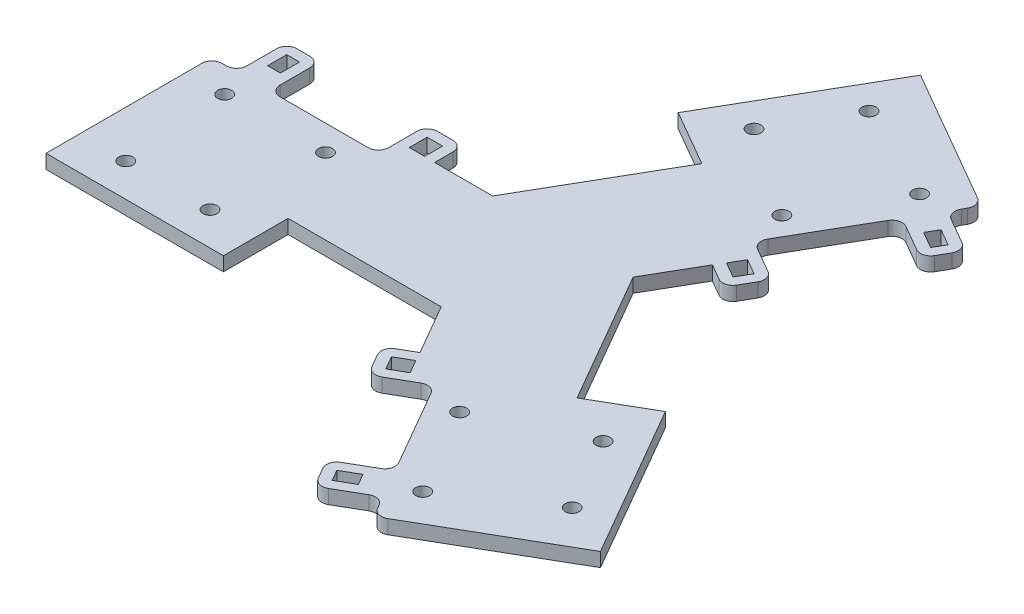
from build123d import *

# Parameters (mm, degrees)
SKETCH3_W           = 69.5
SKETCH3_H           = 65
SKETCH3_W_2         = 63.5
SKETCH3_H_2         = 59
BOSS_EXTRUDE1_DEPTH = 3
SKETCH4_W           = 69.5
SKETCH4_H           = 65
BOSS_EXTRUDE2_DEPTH = 5.5
CIRPATTERN3_COUNT   = 3
CUT_EXTRUDE2_DEPTH  = 10
BOSS_EXTRUDE3_DEPTH = 3
CUT_EXTRUDE3_DEPTH  = 10
BOSS_EXTRUDE4_DEPTH = 3
SKETCH13_W          = 82.978771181
SKETCH13_H          = 57.040542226
CUT_EXTRUDE4_DEPTH  = 3
SKETCH15_W          = 69.5
SKETCH15_H          = 3
BOSS_EXTRUDE5_DEPTH = 3
SKETCH16_W          = 13
SKETCH16_H          = 19.62
SKETCH16_W_2        = 5
SKETCH16_H_2        = 7.5
SKETCH16_W_3        = 6.047492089
SKETCH16_H_3        = 7
BOSS_EXTRUDE6_DEPTH = 5.5
CIRPATTERN6_COUNT   = 3
FILLET1_R           = 4
FILLET2_R           = 4
FILLET3_R           = 4
FILLET4_R           = 4
FILLET5_R           = 4
FILLET6_R           = 4
FILLET7_R           = 4
FILLET8_R           = 4
FILLET9_R           = 4
SKETCH17_R          = 2.75
CUT_EXTRUDE5_DEPTH  = 10
SKETCH18_R          = 2.75
CUT_EXTRUDE6_DEPTH  = 10
SKETCH20_W          = 65.1
SKETCH20_H          = 42.78
CUT_EXTRUDE7_DEPTH  = 3
CIRPATTERN7_COUNT   = 3
SKETCH27_W          = 419.814756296
SKETCH27_H          = 327.807450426
CUT_EXTRUDE9_DEPTH  = 390
BOSS_EXTRUDE7_DEPTH = 5.5


with BuildPart() as part:
    # Sketch3 → Boss-Extrude1 (new body)
    with BuildSketch(Plane(origin=(0, 0, 0), x_dir=(1, 0, 0), z_dir=(0, 1, 0))):
        with Locations((26.22826087, -18.027173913)):
            Rectangle(SKETCH3_W, SKETCH3_H)
        with Locations((26.22826087, -18.027173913)):
            Rectangle(SKETCH3_W_2, SKETCH3_H_2, mode=Mode.SUBTRACT)
    extrude(amount=BOSS_EXTRUDE1_DEPTH)

    # Sketch4 → Boss-Extrude2 (add)
    with BuildSketch(Plane(origin=(0, 3, 0), x_dir=(1, 0, 0), z_dir=(0, 1, 0))):
        with Locations((26.22826087, -18.027173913)):
            Rectangle(SKETCH4_W, SKETCH4_H)
    extrude(amount=BOSS_EXTRUDE2_DEPTH)


with BuildPart() as cirpattern3_1:
    # CirPattern3: pattern copy
    add(part.part.rotate(Axis((120.97826087, 0, -6.582826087), (0, 1, 0)), 1 * 360 / CIRPATTERN3_COUNT))

    # Sketch9 → Cut-Extrude2 (cut)
    with BuildSketch(Plane.XZ.offset(-3)):
        Polygon((197.088747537, 99.38440381), (174.375371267, 112.497977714), (139.363302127, 51.855295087), (162.076678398, 38.741721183), align=None)
    extrude(amount=CUT_EXTRUDE2_DEPTH, mode=Mode.SUBTRACT)

    # Sketch10 → Boss-Extrude3 (add)
    with BuildSketch(Plane.XZ.offset(-3)):
        Polygon((196.92596934, 99.102463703), (162.17596934, 38.91369814), (159.577893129, 40.41369814), (194.327893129, 100.602463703), align=None)
    extrude(amount=BOSS_EXTRUDE3_DEPTH)

    # Fillet9
    fillet9_edges = [cirpattern3_1.edges().sort_by_distance(p)[0] for p in [
        (178.895320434, 5.75, 109.512463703),
    ]]
    fillet(fillet9_edges, radius=FILLET9_R)


with BuildPart() as cirpattern3_2:
    # CirPattern3: pattern copy
    add(part.part.rotate(Axis((120.97826087, 0, -6.582826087), (0, 1, 0)), 2 * 360 / CIRPATTERN3_COUNT))

    # Sketch11 → Cut-Extrude3 (cut)
    with BuildSketch(Plane.XZ.offset(-3)):
        Polygon((174.619846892, -125.352778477), (139.700043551, -64.869904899), (160.048933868, -53.121467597), (194.96873721, -113.604341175), align=None)
    extrude(amount=CUT_EXTRUDE3_DEPTH, mode=Mode.SUBTRACT)

    # Sketch12 → Boss-Extrude4 (add)
    with BuildSketch(Plane(origin=(0, 3, 0), x_dir=(-1, 0, 0), z_dir=(0, -1, 0))):
        Polygon((-174.530552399, 125.198115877), (-139.780552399, 65.009350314), (-142.37862861, 63.509350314), (-177.12862861, 123.698115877), align=None)
    extrude(amount=BOSS_EXTRUDE4_DEPTH)

    # Fillet7
    fillet7_edges = [cirpattern3_2.edges().sort_by_distance(p)[0] for p in [
        (192.561201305, 5.75, -114.788115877),
    ]]
    fillet(fillet7_edges, radius=FILLET7_R)


with BuildPart() as part_1:
    add(part.part)

    # Sketch13 → Cut-Extrude4 (cut)
    with BuildSketch(Plane(origin=(0, 3, 0), x_dir=(-1, 0, 0), z_dir=(0, -1, 0))):
        with Locations((-19.48887528, 25.1730972)):
            Rectangle(SKETCH13_W, SKETCH13_H)
    extrude(amount=CUT_EXTRUDE4_DEPTH, mode=Mode.SUBTRACT)

    # Sketch15 → Boss-Extrude5 (add)
    with BuildSketch(Plane.XZ.offset(-3)):
        with Locations((26.22826087, 4.847173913)):
            Rectangle(SKETCH15_W, SKETCH15_H)
    extrude(amount=BOSS_EXTRUDE5_DEPTH)

    # Sketch16 → Boss-Extrude6 (add)
    # profile 1 of 2: a face of its own
    with BuildSketch(Plane.XZ.offset(-3)):
        with Locations((7.67826087, -24.282826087)):
            Rectangle(SKETCH16_W, SKETCH16_H)
        with Locations((7.67826087, -26.342826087)):
            Rectangle(SKETCH16_W_2, SKETCH16_H_2, mode=Mode.SUBTRACT)
    # profile 2 of 2: a face of its own
    with BuildSketch(Plane.XZ.offset(-3)):
        Polygon((56.67826087, -14.472826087), (60.97826087, -14.472826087), (60.97826087, -22.472785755), (70.725752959, -22.472785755), (70.725752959, -33.592826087), (56.67826087, -33.592826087), align=None)
        with Locations((63.702006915, -26.092826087)):
            Rectangle(SKETCH16_W_3, SKETCH16_H_3, mode=Mode.SUBTRACT)
    extrude(amount=-BOSS_EXTRUDE6_DEPTH)


with BuildPart() as cirpattern6_1:
    # CirPattern6: pattern copy
    add(part_1.part.rotate(Axis((120.97826087, 0, -6.582826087), (0, 1, 0)), 1 * 360 / CIRPATTERN6_COUNT))

    # Fillet3
    fillet3_edges = [cirpattern6_1.edges().sort_by_distance(p)[0] for p in [
        (157.053902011, 5.75, 110.922017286),
        (150.553902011, 5.75, 99.663687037),
        (129.736914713, 5.75, 62.607607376),
        (122.713168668, 5.75, 50.442122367),
    ]]
    fillet(fillet3_edges, radius=FILLET3_R)

    # Fillet5
    fillet5_edges = [cirpattern6_1.edges().sort_by_distance(p)[0] for p in [
        (167.545320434, 5.75, 89.853687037),
        (146.295320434, 5.75, 53.047607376),
        (178.895320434, 5.75, 109.512463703),
    ]]
    fillet(fillet5_edges, radius=FILLET5_R)

    # Fillet8
    fillet8_edges = [cirpattern6_1.edges().sort_by_distance(p)[0] for p in [
        (174.045320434, 5.75, 101.112017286),
    ]]
    fillet(fillet8_edges, radius=FILLET8_R)


with BuildPart() as cirpattern6_2:
    # CirPattern6: pattern copy
    add(part_1.part.rotate(Axis((120.97826087, 0, -6.582826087), (0, 1, 0)), 2 * 360 / CIRPATTERN6_COUNT))

    # Fillet2
    fillet2_edges = [cirpattern6_2.edges().sort_by_distance(p)[0] for p in [
        (204.702619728, 5.75, -96.57766946),
        (198.202619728, 5.75, -85.319339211),
        (176.519607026, 5.75, -48.76325955),
        (169.495860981, 5.75, -36.597774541),
    ]]
    fillet(fillet2_edges, radius=FILLET2_R)

    # Fillet4
    fillet4_edges = [cirpattern6_2.edges().sort_by_distance(p)[0] for p in [
        (187.711201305, 5.75, -106.38766946),
        (181.211201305, 5.75, -95.129339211),
        (159.961201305, 5.75, -58.32325955),
        (192.561201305, 5.75, -114.788115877),
    ]]
    fillet(fillet4_edges, radius=FILLET4_R)


with BuildPart() as part_2:
    add(part_1.part)

    # Fillet1
    fillet1_edges = [part_2.edges().sort_by_distance(p)[0] for p in [
        (1.17826087, 5.75, -34.092826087),
        (14.17826087, 5.75, -34.092826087),
        (56.67826087, 5.75, -33.592826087),
        (70.725752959, 5.75, -33.592826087),
    ]]
    fillet(fillet1_edges, radius=FILLET1_R)

    # Fillet6
    fillet6_edges = [part_2.edges().sort_by_distance(p)[0] for p in [
        (1.17826087, 5.75, -14.472826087),
        (14.17826087, 5.75, -14.472826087),
        (56.67826087, 5.75, -14.472826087),
        (-8.52173913, 5.75, -14.472826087),
    ]]
    fillet(fillet6_edges, radius=FILLET6_R)


with BuildPart() as cut_extrude5_tool:
    # Sketch17 → Cut-Extrude5 (new body)
    with BuildSketch(Plane(origin=(0, 3, 0), x_dir=(-1, 0, 0), z_dir=(0, -1, 0))):
        with Locations(Location((-121.902880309, 96.404313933, 0), (0, 0, 90))):
            Circle(SKETCH17_R)
        with Locations(Location((-138.402880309, 124.983152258, 0), (0, 0, 90))):
            Circle(SKETCH17_R)
    cut_extrude5 = extrude(amount=-CUT_EXTRUDE5_DEPTH)


with BuildPart() as cirpattern3_2_1:
    add(cirpattern3_2.part)

    # Cut-Extrude5: cut by cut_extrude5_tool
    add(cut_extrude5_tool.part, mode=Mode.SUBTRACT)


with BuildPart() as cirpattern6_2_1:
    add(cirpattern6_2.part)

    # Cut-Extrude5: cut by cut_extrude5_tool
    add(cut_extrude5_tool.part, mode=Mode.SUBTRACT)


with BuildPart() as cut_extrude6_tool:
    # Sketch18 → Cut-Extrude6 (new body)
    with BuildSketch(Plane.XZ.offset(-3)):
        with Locations(Location((176.400947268, -106.79773482, 0), (0, 0, 270))):
            Circle(SKETCH18_R)
        with Locations(Location((156.650947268, -72.589731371, 0), (0, 0, 270))):
            Circle(SKETCH18_R)
    cut_extrude6 = extrude(amount=-CUT_EXTRUDE6_DEPTH)


with BuildPart() as cirpattern3_2_2:
    add(cirpattern3_2_1.part)

    # Cut-Extrude6: cut by cut_extrude6_tool
    add(cut_extrude6_tool.part, mode=Mode.SUBTRACT)


with BuildPart() as cirpattern6_2_2:
    add(cirpattern6_2_1.part)

    # Cut-Extrude6: cut by cut_extrude6_tool
    add(cut_extrude6_tool.part, mode=Mode.SUBTRACT)


with BuildPart() as cut_extrude7_tool:
    # Sketch20 → Cut-Extrude7 (new body)
    with BuildSketch(Plane.XZ):
        with Locations((26.22826087, 26.937173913)):
            Rectangle(SKETCH20_W, SKETCH20_H)
        Polygon((195.133149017, 97.597207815), (162.583149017, 41.218954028), (199.631715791, 19.828954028), (232.181715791, 76.207207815), align=None)
        Polygon((174.123372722, -122.892859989), (141.573372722, -66.514606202), (104.524805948, -87.904606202), (137.074805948, -144.282859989), align=None)
    extrude(amount=-CUT_EXTRUDE7_DEPTH)


with BuildPart() as part_3:
    add(part_2.part)

    # Cut-Extrude7: cut by cut_extrude7_tool
    add(cut_extrude7_tool.part, mode=Mode.SUBTRACT)


with BuildPart() as cirpattern3_1_1:
    add(cirpattern3_1.part)

    # Cut-Extrude7: cut by cut_extrude7_tool
    add(cut_extrude7_tool.part, mode=Mode.SUBTRACT)


with BuildPart() as cirpattern3_2_3:
    add(cirpattern3_2_2.part)

    # Cut-Extrude7: cut by cut_extrude7_tool
    add(cut_extrude7_tool.part, mode=Mode.SUBTRACT)


with BuildPart() as cirpattern6_1_1:
    add(cirpattern6_1.part)

    # Cut-Extrude7: cut by cut_extrude7_tool
    add(cut_extrude7_tool.part, mode=Mode.SUBTRACT)


with BuildPart() as cirpattern6_2_3:
    add(cirpattern6_2_2.part)

    # Cut-Extrude7: cut by cut_extrude7_tool
    add(cut_extrude7_tool.part, mode=Mode.SUBTRACT)


with BuildPart() as cirpattern7_tool:
    # CirPattern7: Cut-Extrude5, Cut-Extrude6 ×3 about axis
    cirpattern7_axis = Axis((120.97826087, 0, -6.582826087), (0, 1, 0))
    add([cut_extrude5.rotate(cirpattern7_axis, i * 360 / CIRPATTERN7_COUNT) for i in range(1, CIRPATTERN7_COUNT)])
    add([cut_extrude6.rotate(cirpattern7_axis, i * 360 / CIRPATTERN7_COUNT) for i in range(1, CIRPATTERN7_COUNT)])


with BuildPart() as part_4:
    add(part_3.part)

    # CirPattern7: cut by cirpattern7_tool
    add(cirpattern7_tool.part, mode=Mode.SUBTRACT)


with BuildPart() as cirpattern3_1_2:
    add(cirpattern3_1_1.part)

    # CirPattern7: cut by cirpattern7_tool
    add(cirpattern7_tool.part, mode=Mode.SUBTRACT)


with BuildPart() as cirpattern6_1_2:
    add(cirpattern6_1_1.part)

    # CirPattern7: cut by cirpattern7_tool
    add(cirpattern7_tool.part, mode=Mode.SUBTRACT)


with BuildPart() as cut_extrude9_tool:
    # Sketch27 → Cut-Extrude9 (new body)
    with BuildSketch(Plane.XZ.offset(-3)):
        with Locations((125.901920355, -45.562024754)):
            Rectangle(SKETCH27_W, SKETCH27_H)
    extrude(amount=CUT_EXTRUDE9_DEPTH)


with BuildPart() as part_5:
    add(part_4.part)

    # Cut-Extrude9: cut by cut_extrude9_tool
    add(cut_extrude9_tool.part, mode=Mode.SUBTRACT)



with BuildPart() as cirpattern3_1_3:
    add(cirpattern3_1_2.part)

    # Cut-Extrude9: cut by cut_extrude9_tool
    add(cut_extrude9_tool.part, mode=Mode.SUBTRACT)


with BuildPart() as cirpattern3_2_4:
    add(cirpattern3_2_3.part)

    # Cut-Extrude9: cut by cut_extrude9_tool
    add(cut_extrude9_tool.part, mode=Mode.SUBTRACT)


with BuildPart() as cirpattern6_1_3:
    add(cirpattern6_1_2.part)

    # Cut-Extrude9: cut by cut_extrude9_tool
    add(cut_extrude9_tool.part, mode=Mode.SUBTRACT)


with BuildPart() as cirpattern6_2_4:
    add(cirpattern6_2_3.part)

    # Cut-Extrude9: cut by cut_extrude9_tool
    add(cut_extrude9_tool.part, mode=Mode.SUBTRACT)


with BuildPart() as part_6:
    add(part_5.part)

    add(cirpattern3_1_3.part)  # Boss-Extrude7 merges CirPattern3_1

    add(cirpattern3_2_4.part)  # Boss-Extrude7 merges CirPattern3_2

    add(cirpattern6_1_3.part)  # Boss-Extrude7 merges CirPattern6_1

    add(cirpattern6_2_4.part)  # Boss-Extrude7 merges CirPattern6_2
    # Sketch28 → Boss-Extrude7 (add)
    with BuildSketch(Plane.XZ.offset(-3)):
        Polygon((148.500478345, -22.472785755), (120.97826087, 25.197093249), (93.456043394, -22.472785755), align=None)
        Polygon((120.97826087, 25.197093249), (60.97826087, 25.197093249), (60.97826087, -22.472785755), (93.456043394, -22.472785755), align=None)
        Polygon((137.217152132, 53.323677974), (120.97826087, 25.197093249), (148.500478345, -22.472785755), (178.500478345, 29.488738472), align=None)
        Polygon((148.500478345, -22.472785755), (93.456043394, -22.472785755), (123.456043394, -74.434309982), (164.739369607, -50.59937048), align=None)
    extrude(amount=-BOSS_EXTRUDE7_DEPTH)


solid = part_6.part
